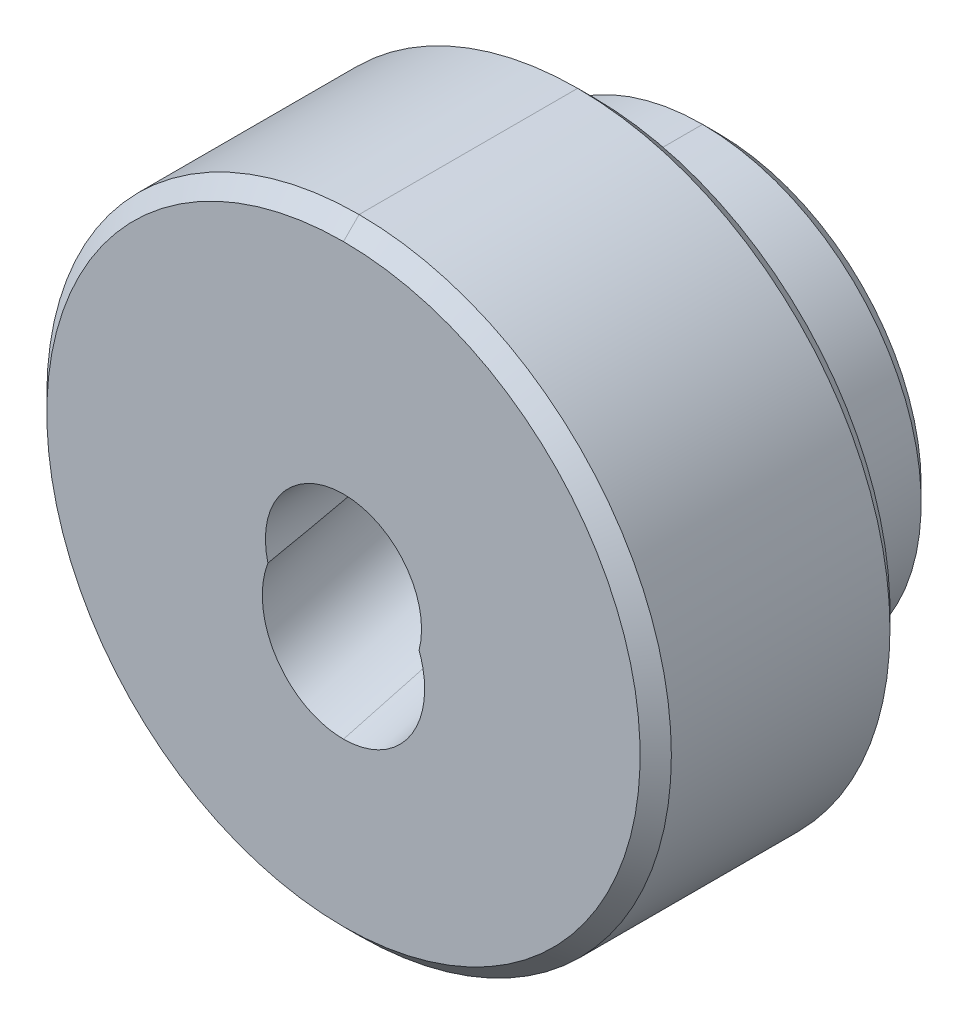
ISO-10303-21;
HEADER;
FILE_DESCRIPTION(('STEP AP214'),'2;1');
FILE_NAME('part.step','',(''),(''),'','','');
FILE_SCHEMA(('AUTOMOTIVE_DESIGN { 1 0 10303 214 1 1 1 1 }'));
ENDSEC;
DATA;
#1=APPLICATION_CONTEXT('core data for automotive mechanical design processes');
#2=APPLICATION_PROTOCOL_DEFINITION('international standard','automotive_design',2000,#1);
#3=PRODUCT_CONTEXT('',#1,'mechanical');
#4=PRODUCT('Part','Part','',(#3));
#5=PRODUCT_RELATED_PRODUCT_CATEGORY('part','',(#4));
#6=PRODUCT_DEFINITION_FORMATION('','',#4);
#7=PRODUCT_DEFINITION_CONTEXT('part definition',#1,'design');
#8=PRODUCT_DEFINITION('design','',#6,#7);
#9=PRODUCT_DEFINITION_SHAPE('','',#8);
#10=(LENGTH_UNIT() NAMED_UNIT(*) SI_UNIT(.MILLI.,.METRE.));
#11=(NAMED_UNIT(*) PLANE_ANGLE_UNIT() SI_UNIT($,.RADIAN.));
#12=(NAMED_UNIT(*) SI_UNIT($,.STERADIAN.) SOLID_ANGLE_UNIT());
#13=UNCERTAINTY_MEASURE_WITH_UNIT(LENGTH_MEASURE(1.E-05),#10,'distance_accuracy_value','');
#14=(GEOMETRIC_REPRESENTATION_CONTEXT(3) GLOBAL_UNCERTAINTY_ASSIGNED_CONTEXT((#13)) GLOBAL_UNIT_ASSIGNED_CONTEXT((#10,
#11,#12)) REPRESENTATION_CONTEXT('',''));
#15=CARTESIAN_POINT('',(0.,0.,0.));
#16=DIRECTION('',(0.,0.,1.));
#17=DIRECTION('',(1.,0.,0.));
#18=AXIS2_PLACEMENT_3D('',#15,#16,#17);
#19=CARTESIAN_POINT('',(0.,0.,3.5));
#20=DIRECTION('',(0.,0.,1.));
#21=DIRECTION('',(1.,0.,0.));
#22=AXIS2_PLACEMENT_3D('',#19,#20,#21);
#23=CYLINDRICAL_SURFACE('',#22,7.);
#24=CARTESIAN_POINT('',(0.,0.,3.5));
#25=DIRECTION('',(0.,0.,1.));
#26=DIRECTION('',(1.,0.,0.));
#27=AXIS2_PLACEMENT_3D('',#24,#25,#26);
#28=CIRCLE('',#27,7.);
#29=CARTESIAN_POINT('',(-7.,0.,3.5));
#30=VERTEX_POINT('',#29);
#31=CARTESIAN_POINT('',(0.,-7.,3.5));
#32=VERTEX_POINT('',#31);
#33=EDGE_CURVE('E280',#30,#32,#28,.T.);
#34=ORIENTED_EDGE('',*,*,#33,.F.);
#35=CARTESIAN_POINT('',(0.,0.,3.5));
#36=DIRECTION('',(0.,0.,1.));
#37=DIRECTION('',(1.,0.,0.));
#38=AXIS2_PLACEMENT_3D('',#35,#36,#37);
#39=CIRCLE('',#38,7.);
#40=CARTESIAN_POINT('',(0.,7.,3.5));
#41=VERTEX_POINT('',#40);
#42=EDGE_CURVE('E273',#41,#30,#39,.T.);
#43=ORIENTED_EDGE('',*,*,#42,.F.);
#44=DIRECTION('',(0.,0.,1.));
#45=VECTOR('',#44,1.);
#46=CARTESIAN_POINT('',(0.,7.,2.));
#47=LINE('',#46,#45);
#48=CARTESIAN_POINT('',(0.,7.,0.5));
#49=VERTEX_POINT('',#48);
#50=EDGE_CURVE('E115',#49,#41,#47,.T.);
#51=ORIENTED_EDGE('',*,*,#50,.F.);
#52=CARTESIAN_POINT('',(0.,0.,0.5));
#53=DIRECTION('',(0.,0.,-1.));
#54=DIRECTION('',(0.,1.,0.));
#55=AXIS2_PLACEMENT_3D('',#52,#53,#54);
#56=CIRCLE('',#55,7.);
#57=CARTESIAN_POINT('',(0.,-7.,0.5));
#58=VERTEX_POINT('',#57);
#59=EDGE_CURVE('E182',#58,#49,#56,.T.);
#60=ORIENTED_EDGE('',*,*,#59,.F.);
#61=DIRECTION('',(0.,0.,-1.));
#62=VECTOR('',#61,1.);
#63=CARTESIAN_POINT('',(0.,-7.,2.));
#64=LINE('',#63,#62);
#65=EDGE_CURVE('E486',#32,#58,#64,.T.);
#66=ORIENTED_EDGE('',*,*,#65,.F.);
#67=EDGE_LOOP('',(#34,#43,#51,#60,#66));
#68=FACE_BOUND('',#67,.T.);
#69=ADVANCED_FACE('F14',(#68),#23,.T.);
#70=CARTESIAN_POINT('',(0.,0.,3.5));
#71=DIRECTION('',(0.,0.,1.));
#72=DIRECTION('',(1.,0.,0.));
#73=AXIS2_PLACEMENT_3D('',#70,#71,#72);
#74=CYLINDRICAL_SURFACE('',#73,7.);
#75=ORIENTED_EDGE('',*,*,#65,.T.);
#76=CARTESIAN_POINT('',(0.,0.,0.5));
#77=DIRECTION('',(0.,0.,-1.));
#78=DIRECTION('',(0.,1.,0.));
#79=AXIS2_PLACEMENT_3D('',#76,#77,#78);
#80=CIRCLE('',#79,7.);
#81=EDGE_CURVE('E168',#49,#58,#80,.T.);
#82=ORIENTED_EDGE('',*,*,#81,.F.);
#83=ORIENTED_EDGE('',*,*,#50,.T.);
#84=CARTESIAN_POINT('',(0.,0.,3.5));
#85=DIRECTION('',(0.,0.,1.));
#86=DIRECTION('',(1.,0.,0.));
#87=AXIS2_PLACEMENT_3D('',#84,#85,#86);
#88=CIRCLE('',#87,7.);
#89=CARTESIAN_POINT('',(7.,0.,3.5));
#90=VERTEX_POINT('',#89);
#91=EDGE_CURVE('E271',#90,#41,#88,.T.);
#92=ORIENTED_EDGE('',*,*,#91,.F.);
#93=CARTESIAN_POINT('',(0.,0.,3.5));
#94=DIRECTION('',(0.,0.,1.));
#95=DIRECTION('',(1.,0.,0.));
#96=AXIS2_PLACEMENT_3D('',#93,#94,#95);
#97=CIRCLE('',#96,7.);
#98=EDGE_CURVE('E216',#32,#90,#97,.T.);
#99=ORIENTED_EDGE('',*,*,#98,.F.);
#100=EDGE_LOOP('',(#75,#82,#83,#92,#99));
#101=FACE_BOUND('',#100,.T.);
#102=ADVANCED_FACE('F466',(#101),#74,.T.);
#103=CARTESIAN_POINT('',(0.,0.,3.5));
#104=DIRECTION('',(0.,0.,1.));
#105=DIRECTION('',(1.,0.,0.));
#106=AXIS2_PLACEMENT_3D('',#103,#104,#105);
#107=TOROIDAL_SURFACE('',#106,7.5,0.5);
#108=CARTESIAN_POINT('',(7.5,0.,3.5));
#109=DIRECTION('',(0.,-1.,0.));
#110=DIRECTION('',(-1.,0.,0.));
#111=AXIS2_PLACEMENT_3D('',#108,#109,#110);
#112=CIRCLE('',#111,0.5);
#113=CARTESIAN_POINT('',(7.5,0.,4.));
#114=VERTEX_POINT('',#113);
#115=EDGE_CURVE('E215',#114,#90,#112,.T.);
#116=ORIENTED_EDGE('',*,*,#115,.F.);
#117=CARTESIAN_POINT('',(0.,0.,4.));
#118=DIRECTION('',(0.,0.,-1.));
#119=DIRECTION('',(1.,0.,0.));
#120=AXIS2_PLACEMENT_3D('',#117,#118,#119);
#121=CIRCLE('',#120,7.5);
#122=CARTESIAN_POINT('',(-7.5,0.,4.));
#123=VERTEX_POINT('',#122);
#124=EDGE_CURVE('E156',#123,#114,#121,.F.);
#125=ORIENTED_EDGE('',*,*,#124,.F.);
#126=CARTESIAN_POINT('',(-7.5,0.,3.5));
#127=DIRECTION('',(0.,1.,0.));
#128=DIRECTION('',(1.,0.,0.));
#129=AXIS2_PLACEMENT_3D('',#126,#127,#128);
#130=CIRCLE('',#129,0.5);
#131=EDGE_CURVE('E208',#30,#123,#130,.F.);
#132=ORIENTED_EDGE('',*,*,#131,.F.);
#133=ORIENTED_EDGE('',*,*,#33,.T.);
#134=ORIENTED_EDGE('',*,*,#98,.T.);
#135=EDGE_LOOP('',(#116,#125,#132,#133,#134));
#136=FACE_BOUND('',#135,.T.);
#137=ADVANCED_FACE('F193',(#136),#107,.F.);
#138=CARTESIAN_POINT('',(0.,0.,3.5));
#139=DIRECTION('',(0.,0.,1.));
#140=DIRECTION('',(1.,0.,0.));
#141=AXIS2_PLACEMENT_3D('',#138,#139,#140);
#142=TOROIDAL_SURFACE('',#141,7.5,0.5);
#143=ORIENTED_EDGE('',*,*,#91,.T.);
#144=ORIENTED_EDGE('',*,*,#42,.T.);
#145=ORIENTED_EDGE('',*,*,#131,.T.);
#146=CARTESIAN_POINT('',(0.,0.,4.));
#147=DIRECTION('',(0.,0.,-1.));
#148=DIRECTION('',(-1.,0.,0.));
#149=AXIS2_PLACEMENT_3D('',#146,#147,#148);
#150=CIRCLE('',#149,7.5);
#151=CARTESIAN_POINT('',(0.,7.5,4.));
#152=VERTEX_POINT('',#151);
#153=EDGE_CURVE('E162',#152,#123,#150,.F.);
#154=ORIENTED_EDGE('',*,*,#153,.F.);
#155=CARTESIAN_POINT('',(0.,0.,4.));
#156=DIRECTION('',(0.,0.,-1.));
#157=DIRECTION('',(0.,1.,0.));
#158=AXIS2_PLACEMENT_3D('',#155,#156,#157);
#159=CIRCLE('',#158,7.5);
#160=EDGE_CURVE('E151',#114,#152,#159,.F.);
#161=ORIENTED_EDGE('',*,*,#160,.F.);
#162=ORIENTED_EDGE('',*,*,#115,.T.);
#163=EDGE_LOOP('',(#143,#144,#145,#154,#161,#162));
#164=FACE_BOUND('',#163,.T.);
#165=ADVANCED_FACE('F187',(#164),#142,.F.);
#166=CARTESIAN_POINT('',(0.,0.,0.));
#167=DIRECTION('',(0.,0.,1.));
#168=DIRECTION('',(1.,0.,0.));
#169=AXIS2_PLACEMENT_3D('',#166,#167,#168);
#170=CONICAL_SURFACE('',#169,6.5,0.785398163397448);
#171=DIRECTION('',(0.,0.707106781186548,-0.707106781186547));
#172=VECTOR('',#171,1.);
#173=CARTESIAN_POINT('',(0.,-4.94974746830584,-1.55025253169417));
#174=LINE('',#173,#172);
#175=CARTESIAN_POINT('',(0.,-6.5,0.));
#176=VERTEX_POINT('',#175);
#177=EDGE_CURVE('E165',#58,#176,#174,.T.);
#178=ORIENTED_EDGE('',*,*,#177,.F.);
#179=ORIENTED_EDGE('',*,*,#59,.T.);
#180=DIRECTION('',(0.,0.707106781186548,0.707106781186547));
#181=VECTOR('',#180,1.);
#182=CARTESIAN_POINT('',(0.,4.94974746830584,-1.55025253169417));
#183=LINE('',#182,#181);
#184=CARTESIAN_POINT('',(0.,6.5,0.));
#185=VERTEX_POINT('',#184);
#186=EDGE_CURVE('E174',#185,#49,#183,.T.);
#187=ORIENTED_EDGE('',*,*,#186,.F.);
#188=CARTESIAN_POINT('',(0.,0.,0.));
#189=DIRECTION('',(0.,0.,1.));
#190=DIRECTION('',(1.,0.,0.));
#191=AXIS2_PLACEMENT_3D('',#188,#189,#190);
#192=CIRCLE('',#191,6.5);
#193=EDGE_CURVE('E148',#176,#185,#192,.F.);
#194=ORIENTED_EDGE('',*,*,#193,.F.);
#195=EDGE_LOOP('',(#178,#179,#187,#194));
#196=FACE_BOUND('',#195,.T.);
#197=ADVANCED_FACE('F192',(#196),#170,.T.);
#198=CARTESIAN_POINT('',(0.,0.,0.));
#199=DIRECTION('',(0.,0.,1.));
#200=DIRECTION('',(1.,0.,0.));
#201=AXIS2_PLACEMENT_3D('',#198,#199,#200);
#202=CONICAL_SURFACE('',#201,6.5,0.785398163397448);
#203=ORIENTED_EDGE('',*,*,#177,.T.);
#204=CARTESIAN_POINT('',(0.,0.,0.));
#205=DIRECTION('',(0.,0.,1.));
#206=DIRECTION('',(1.,0.,0.));
#207=AXIS2_PLACEMENT_3D('',#204,#205,#206);
#208=CIRCLE('',#207,6.5);
#209=EDGE_CURVE('E145',#185,#176,#208,.F.);
#210=ORIENTED_EDGE('',*,*,#209,.F.);
#211=ORIENTED_EDGE('',*,*,#186,.T.);
#212=ORIENTED_EDGE('',*,*,#81,.T.);
#213=EDGE_LOOP('',(#203,#210,#211,#212));
#214=FACE_BOUND('',#213,.T.);
#215=ADVANCED_FACE('F233',(#214),#202,.T.);
#216=CARTESIAN_POINT('',(9.61400210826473,9.5,4.));
#217=DIRECTION('',(0.,0.,-1.));
#218=DIRECTION('',(0.,-1.,0.));
#219=AXIS2_PLACEMENT_3D('',#216,#217,#218);
#220=PLANE('',#219);
#221=ORIENTED_EDGE('',*,*,#124,.T.);
#222=ORIENTED_EDGE('',*,*,#160,.T.);
#223=ORIENTED_EDGE('',*,*,#153,.T.);
#224=EDGE_LOOP('',(#221,#222,#223));
#225=FACE_BOUND('',#224,.T.);
#226=CARTESIAN_POINT('',(0.,0.,4.));
#227=DIRECTION('',(0.,0.,1.));
#228=DIRECTION('',(1.,0.,0.));
#229=AXIS2_PLACEMENT_3D('',#226,#227,#228);
#230=CIRCLE('',#229,9.5);
#231=CARTESIAN_POINT('',(0.,9.5,4.));
#232=VERTEX_POINT('',#231);
#233=CARTESIAN_POINT('',(0.,-9.5,4.));
#234=VERTEX_POINT('',#233);
#235=EDGE_CURVE('E140',#232,#234,#230,.T.);
#236=ORIENTED_EDGE('',*,*,#235,.F.);
#237=CARTESIAN_POINT('',(0.,0.,4.));
#238=DIRECTION('',(0.,0.,1.));
#239=DIRECTION('',(1.,0.,0.));
#240=AXIS2_PLACEMENT_3D('',#237,#238,#239);
#241=CIRCLE('',#240,9.5);
#242=EDGE_CURVE('E150',#234,#232,#241,.T.);
#243=ORIENTED_EDGE('',*,*,#242,.F.);
#244=EDGE_LOOP('',(#236,#243));
#245=FACE_BOUND('',#244,.T.);
#246=ADVANCED_FACE('F223',(#225,#245),#220,.T.);
#247=CARTESIAN_POINT('',(0.,0.,4.));
#248=DIRECTION('',(0.,0.,1.));
#249=DIRECTION('',(1.,0.,0.));
#250=AXIS2_PLACEMENT_3D('',#247,#248,#249);
#251=CONICAL_SURFACE('',#250,9.5,0.785398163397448);
#252=DIRECTION('',(0.,-0.707106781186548,0.707106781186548));
#253=VECTOR('',#252,1.);
#254=CARTESIAN_POINT('',(0.,-7.07106781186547,1.57106781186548));
#255=LINE('',#254,#253);
#256=CARTESIAN_POINT('',(0.,-10.,4.5));
#257=VERTEX_POINT('',#256);
#258=EDGE_CURVE('E143',#234,#257,#255,.T.);
#259=ORIENTED_EDGE('',*,*,#258,.F.);
#260=ORIENTED_EDGE('',*,*,#242,.T.);
#261=DIRECTION('',(0.,-0.707106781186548,-0.707106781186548));
#262=VECTOR('',#261,1.);
#263=CARTESIAN_POINT('',(0.,7.07106781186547,1.57106781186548));
#264=LINE('',#263,#262);
#265=CARTESIAN_POINT('',(0.,10.,4.5));
#266=VERTEX_POINT('',#265);
#267=EDGE_CURVE('E144',#266,#232,#264,.T.);
#268=ORIENTED_EDGE('',*,*,#267,.F.);
#269=CARTESIAN_POINT('',(0.,0.,4.5));
#270=DIRECTION('',(0.,0.,1.));
#271=DIRECTION('',(0.,1.,0.));
#272=AXIS2_PLACEMENT_3D('',#269,#270,#271);
#273=CIRCLE('',#272,10.);
#274=EDGE_CURVE('E309',#257,#266,#273,.T.);
#275=ORIENTED_EDGE('',*,*,#274,.F.);
#276=EDGE_LOOP('',(#259,#260,#268,#275));
#277=FACE_BOUND('',#276,.T.);
#278=ADVANCED_FACE('F232',(#277),#251,.T.);
#279=CARTESIAN_POINT('',(6.57800210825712,6.5,0.));
#280=DIRECTION('',(0.,0.,-1.));
#281=DIRECTION('',(0.,-1.,0.));
#282=AXIS2_PLACEMENT_3D('',#279,#280,#281);
#283=PLANE('',#282);
#284=CARTESIAN_POINT('',(0.,0.,0.));
#285=DIRECTION('',(0.,0.,-1.));
#286=DIRECTION('',(-1.,0.,0.));
#287=AXIS2_PLACEMENT_3D('',#284,#285,#286);
#288=CIRCLE('',#287,2.5);
#289=CARTESIAN_POINT('',(2.42058312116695,0.625121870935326,0.));
#290=VERTEX_POINT('',#289);
#291=CARTESIAN_POINT('',(-2.42058312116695,0.625121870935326,0.));
#292=VERTEX_POINT('',#291);
#293=EDGE_CURVE('E28',#290,#292,#288,.T.);
#294=ORIENTED_EDGE('',*,*,#293,.F.);
#295=CARTESIAN_POINT('',(0.,1.60769515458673,0.));
#296=DIRECTION('',(0.,0.,-1.));
#297=DIRECTION('',(0.,-1.,0.));
#298=AXIS2_PLACEMENT_3D('',#295,#296,#297);
#299=ELLIPSE('',#298,2.69171806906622,2.6);
#300=CARTESIAN_POINT('',(0.,4.29941322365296,0.));
#301=VERTEX_POINT('',#300);
#302=EDGE_CURVE('E122',#301,#290,#299,.T.);
#303=ORIENTED_EDGE('',*,*,#302,.F.);
#304=CARTESIAN_POINT('',(0.,1.60769515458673,0.));
#305=DIRECTION('',(0.,0.,-1.));
#306=DIRECTION('',(0.,-1.,0.));
#307=AXIS2_PLACEMENT_3D('',#304,#305,#306);
#308=ELLIPSE('',#307,2.69171806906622,2.6);
#309=EDGE_CURVE('E124',#292,#301,#308,.T.);
#310=ORIENTED_EDGE('',*,*,#309,.F.);
#311=EDGE_LOOP('',(#294,#303,#310));
#312=FACE_BOUND('',#311,.T.);
#313=ORIENTED_EDGE('',*,*,#193,.T.);
#314=ORIENTED_EDGE('',*,*,#209,.T.);
#315=EDGE_LOOP('',(#313,#314));
#316=FACE_BOUND('',#315,.T.);
#317=ADVANCED_FACE('F120',(#312,#316),#283,.T.);
#318=CARTESIAN_POINT('',(0.,0.,4.));
#319=DIRECTION('',(0.,0.,1.));
#320=DIRECTION('',(1.,0.,0.));
#321=AXIS2_PLACEMENT_3D('',#318,#319,#320);
#322=CONICAL_SURFACE('',#321,9.5,0.785398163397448);
#323=ORIENTED_EDGE('',*,*,#258,.T.);
#324=CARTESIAN_POINT('',(0.,0.,4.5));
#325=DIRECTION('',(0.,0.,1.));
#326=DIRECTION('',(0.,1.,0.));
#327=AXIS2_PLACEMENT_3D('',#324,#325,#326);
#328=CIRCLE('',#327,10.);
#329=EDGE_CURVE('E178',#266,#257,#328,.T.);
#330=ORIENTED_EDGE('',*,*,#329,.F.);
#331=ORIENTED_EDGE('',*,*,#267,.T.);
#332=ORIENTED_EDGE('',*,*,#235,.T.);
#333=EDGE_LOOP('',(#323,#330,#331,#332));
#334=FACE_BOUND('',#333,.T.);
#335=ADVANCED_FACE('F372',(#334),#322,.T.);
#336=CARTESIAN_POINT('',(0.,0.,11.5));
#337=DIRECTION('',(0.,0.,1.));
#338=DIRECTION('',(1.,0.,0.));
#339=AXIS2_PLACEMENT_3D('',#336,#337,#338);
#340=CYLINDRICAL_SURFACE('',#339,10.);
#341=DIRECTION('',(0.,0.,1.));
#342=VECTOR('',#341,1.);
#343=CARTESIAN_POINT('',(0.,-10.,8.));
#344=LINE('',#343,#342);
#345=CARTESIAN_POINT('',(0.,-10.,11.5));
#346=VERTEX_POINT('',#345);
#347=EDGE_CURVE('E290',#257,#346,#344,.T.);
#348=ORIENTED_EDGE('',*,*,#347,.F.);
#349=ORIENTED_EDGE('',*,*,#274,.T.);
#350=DIRECTION('',(0.,0.,-1.));
#351=VECTOR('',#350,1.);
#352=CARTESIAN_POINT('',(0.,10.,8.));
#353=LINE('',#352,#351);
#354=CARTESIAN_POINT('',(0.,10.,11.5));
#355=VERTEX_POINT('',#354);
#356=EDGE_CURVE('E301',#355,#266,#353,.T.);
#357=ORIENTED_EDGE('',*,*,#356,.F.);
#358=CARTESIAN_POINT('',(0.,0.,11.5));
#359=DIRECTION('',(0.,0.,1.));
#360=DIRECTION('',(0.,1.,0.));
#361=AXIS2_PLACEMENT_3D('',#358,#359,#360);
#362=CIRCLE('',#361,10.);
#363=EDGE_CURVE('E130',#346,#355,#362,.T.);
#364=ORIENTED_EDGE('',*,*,#363,.F.);
#365=EDGE_LOOP('',(#348,#349,#357,#364));
#366=FACE_BOUND('',#365,.T.);
#367=ADVANCED_FACE('F365',(#366),#340,.T.);
#368=CARTESIAN_POINT('',(0.,0.,12.));
#369=DIRECTION('',(0.,0.,-1.));
#370=DIRECTION('',(-1.,0.,0.));
#371=AXIS2_PLACEMENT_3D('',#368,#369,#370);
#372=CONICAL_SURFACE('',#371,9.5,0.785398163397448);
#373=DIRECTION('',(0.,-0.707106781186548,-0.707106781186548));
#374=VECTOR('',#373,1.);
#375=CARTESIAN_POINT('',(0.,-7.07106781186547,14.4289321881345));
#376=LINE('',#375,#374);
#377=CARTESIAN_POINT('',(0.,-9.5,12.));
#378=VERTEX_POINT('',#377);
#379=EDGE_CURVE('E135',#378,#346,#376,.T.);
#380=ORIENTED_EDGE('',*,*,#379,.T.);
#381=ORIENTED_EDGE('',*,*,#363,.T.);
#382=DIRECTION('',(0.,-0.707106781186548,0.707106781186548));
#383=VECTOR('',#382,1.);
#384=CARTESIAN_POINT('',(0.,7.07106781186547,14.4289321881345));
#385=LINE('',#384,#383);
#386=CARTESIAN_POINT('',(0.,9.5,12.));
#387=VERTEX_POINT('',#386);
#388=EDGE_CURVE('E311',#355,#387,#385,.T.);
#389=ORIENTED_EDGE('',*,*,#388,.T.);
#390=CARTESIAN_POINT('',(0.,0.,12.));
#391=DIRECTION('',(0.,0.,-1.));
#392=DIRECTION('',(-1.,0.,0.));
#393=AXIS2_PLACEMENT_3D('',#390,#391,#392);
#394=CIRCLE('',#393,9.5);
#395=EDGE_CURVE('E288',#378,#387,#394,.F.);
#396=ORIENTED_EDGE('',*,*,#395,.F.);
#397=EDGE_LOOP('',(#380,#381,#389,#396));
#398=FACE_BOUND('',#397,.T.);
#399=ADVANCED_FACE('F363',(#398),#372,.T.);
#400=CARTESIAN_POINT('',(0.,1.78810110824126,-0.673284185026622));
#401=DIRECTION('',(0.,-0.25881904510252,0.965925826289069));
#402=DIRECTION('',(0.,-0.965925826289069,-0.25881904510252));
#403=AXIS2_PLACEMENT_3D('',#400,#401,#402);
#404=CYLINDRICAL_SURFACE('',#403,2.6);
#405=CARTESIAN_POINT('',(0.,2.5,6.71550157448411));
#406=CARTESIAN_POINT('',(0.0702065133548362,2.50000683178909,6.71550781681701));
#407=CARTESIAN_POINT('',(0.140410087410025,2.49704270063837,6.71555189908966));
#408=CARTESIAN_POINT('',(0.280316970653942,2.4852247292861,6.71576068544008));
#409=CARTESIAN_POINT('',(0.350020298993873,2.47637111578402,6.71592538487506));
#410=CARTESIAN_POINT('',(0.488353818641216,2.45284067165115,6.7164200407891));
#411=CARTESIAN_POINT('',(0.556985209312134,2.43817091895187,6.71674979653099));
#412=CARTESIAN_POINT('',(0.69275444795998,2.40312547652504,6.71767088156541));
#413=CARTESIAN_POINT('',(0.759892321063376,2.38274988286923,6.71826220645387));
#414=CARTESIAN_POINT('',(0.958392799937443,2.31324564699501,6.72061843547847));
#415=CARTESIAN_POINT('',(1.08691525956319,2.2557270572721,6.72296560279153));
#416=CARTESIAN_POINT('',(1.33256067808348,2.11990274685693,6.7309698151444));
#417=CARTESIAN_POINT('',(1.44967155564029,2.04157531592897,6.73663032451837));
#418=CARTESIAN_POINT('',(1.61366891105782,1.91074705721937,6.75013351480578));
#419=CARTESIAN_POINT('',(1.66629045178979,1.86502587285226,6.75545341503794));
#420=CARTESIAN_POINT('',(1.7673771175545,1.76952045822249,6.7684426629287));
#421=CARTESIAN_POINT('',(1.81584436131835,1.71973832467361,6.77611080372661));
#422=CARTESIAN_POINT('',(1.90812831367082,1.61673099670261,6.79466584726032));
#423=CARTESIAN_POINT('',(1.95195274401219,1.56351176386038,6.80554728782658));
#424=CARTESIAN_POINT('',(2.03457248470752,1.45437103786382,6.83171139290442));
#425=CARTESIAN_POINT('',(2.07337196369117,1.3984518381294,6.84699037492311));
#426=CARTESIAN_POINT('',(2.15131636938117,1.27589270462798,6.88637999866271));
#427=CARTESIAN_POINT('',(2.1895243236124,1.20896837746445,6.91151222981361));
#428=CARTESIAN_POINT('',(2.25788492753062,1.07588414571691,6.97220888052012));
#429=CARTESIAN_POINT('',(2.28806109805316,1.00972256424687,7.00774218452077));
#430=CARTESIAN_POINT('',(2.34055113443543,0.881295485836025,7.09108427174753));
#431=CARTESIAN_POINT('',(2.36280429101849,0.819062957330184,7.13898318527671));
#432=CARTESIAN_POINT('',(2.4001028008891,0.702356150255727,7.24576266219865));
#433=CARTESIAN_POINT('',(2.41514254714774,0.647887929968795,7.30465171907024));
#434=CARTESIAN_POINT('',(2.43601028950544,0.563134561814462,7.41072703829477));
#435=CARTESIAN_POINT('',(2.44324867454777,0.530580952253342,7.45589776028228));
#436=CARTESIAN_POINT('',(2.45577567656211,0.469199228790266,7.54898163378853));
#437=CARTESIAN_POINT('',(2.46106314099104,0.440373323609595,7.59689638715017));
#438=CARTESIAN_POINT('',(2.4702014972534,0.385840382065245,7.69489364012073));
#439=CARTESIAN_POINT('',(2.47404494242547,0.360149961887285,7.74498592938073));
#440=CARTESIAN_POINT('',(2.48063554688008,0.311520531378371,7.8465236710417));
#441=CARTESIAN_POINT('',(2.48338304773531,0.288580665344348,7.89796869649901));
#442=CARTESIAN_POINT('',(2.49034585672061,0.223763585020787,8.05219869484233));
#443=CARTESIAN_POINT('',(2.49339980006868,0.185101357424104,8.15637861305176));
#444=CARTESIAN_POINT('',(2.49767119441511,0.113579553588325,8.36677297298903));
#445=CARTESIAN_POINT('',(2.49888693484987,0.0807254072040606,8.47298921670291));
#446=CARTESIAN_POINT('',(2.50011905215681,0.0189698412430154,8.68684219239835));
#447=CARTESIAN_POINT('',(2.50013246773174,-0.00992164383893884,8.79448177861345));
#448=CARTESIAN_POINT('',(2.49930881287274,-0.0648237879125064,9.0104955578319));
#449=CARTESIAN_POINT('',(2.4984716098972,-0.0908339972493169,9.11886986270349));
#450=CARTESIAN_POINT('',(2.49499520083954,-0.165980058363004,9.4456802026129));
#451=CARTESIAN_POINT('',(2.49139010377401,-0.211966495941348,9.66482475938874));
#452=CARTESIAN_POINT('',(2.48242130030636,-0.299111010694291,10.1036671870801));
#453=CARTESIAN_POINT('',(2.47706018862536,-0.340276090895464,10.3233637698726));
#454=CARTESIAN_POINT('',(2.46703512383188,-0.40546477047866,10.6849811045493));
#455=CARTESIAN_POINT('',(2.46280209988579,-0.430374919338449,10.8267548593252));
#456=CARTESIAN_POINT('',(2.45376277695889,-0.479234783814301,11.11050609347));
#457=CARTESIAN_POINT('',(2.44895625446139,-0.503184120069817,11.2524836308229));
#458=CARTESIAN_POINT('',(2.4388427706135,-0.550106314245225,11.5352123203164));
#459=CARTESIAN_POINT('',(2.43354092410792,-0.573086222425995,11.6759624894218));
#460=CARTESIAN_POINT('',(2.42241144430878,-0.618436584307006,11.9574807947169));
#461=CARTESIAN_POINT('',(2.41658402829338,-0.640807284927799,12.0982488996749));
#462=CARTESIAN_POINT('',(2.41049766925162,-0.662948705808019,12.2390412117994));
#463=B_SPLINE_CURVE_WITH_KNOTS('',3,(#405,#406,#407,#408,#409,#410,#411,#412,#413,#414,#415,
#416,#417,#418,#419,#420,#421,#422,#423,#424,#425,#426,#427,#428,#429,#430,#431,#432,#433,#434,
#435,#436,#437,#438,#439,#440,#441,#442,#443,#444,#445,#446,#447,#448,#449,#450,#451,#452,#453,
#454,#455,#456,#457,#458,#459,#460,#461,#462),.UNSPECIFIED.,.F.,.F.,(4,2,2,2,2,2,2,2,2,2,2,2,2,
2,2,2,2,2,2,2,2,2,2,2,2,2,2,2,4),(0.,0.210551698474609,0.421095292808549,0.631383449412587,
0.841668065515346,1.26201795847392,1.68280814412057,1.89231567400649,2.10171570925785,
2.31076182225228,2.51963338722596,2.76190670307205,3.00346252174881,3.24683130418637,
3.49038895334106,3.6585993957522,3.82690905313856,3.99607512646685,4.16518843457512,
4.49834227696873,4.83180594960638,5.16609091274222,5.50042797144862,6.17214172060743,
6.84286737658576,7.27488527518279,7.7070721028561,8.13520660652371,8.56316491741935),.UNSPECIFIED.);
#464=CARTESIAN_POINT('',(0.,2.5,6.71550157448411));
#465=VERTEX_POINT('',#464);
#466=CARTESIAN_POINT('',(2.42058312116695,-0.625121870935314,12.));
#467=VERTEX_POINT('',#466);
#468=EDGE_CURVE('E35',#465,#467,#463,.T.);
#469=ORIENTED_EDGE('',*,*,#468,.F.);
#470=DIRECTION('',(0.,-0.258819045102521,0.965925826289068));
#471=VECTOR('',#470,1.);
#472=CARTESIAN_POINT('',(0.,2.51140714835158,6.67292951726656));
#473=LINE('',#472,#471);
#474=EDGE_CURVE('E129',#301,#465,#473,.T.);
#475=ORIENTED_EDGE('',*,*,#474,.F.);
#476=ORIENTED_EDGE('',*,*,#302,.T.);
#477=CARTESIAN_POINT('',(0.,-2.5,5.28449842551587));
#478=CARTESIAN_POINT('',(0.0702064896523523,-2.50000683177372,5.28449218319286));
#479=CARTESIAN_POINT('',(0.140410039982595,-2.49704270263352,5.28444810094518));
#480=CARTESIAN_POINT('',(0.280316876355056,-2.48522473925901,5.28423931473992));
#481=CARTESIAN_POINT('',(0.350020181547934,-2.4763711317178,5.28407461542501));
#482=CARTESIAN_POINT('',(0.48835370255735,-2.45284069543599,5.28357995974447));
#483=CARTESIAN_POINT('',(0.556985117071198,-2.43817094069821,5.28325020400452));
#484=CARTESIAN_POINT('',(0.692754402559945,-2.40312549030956,5.28232911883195));
#485=CARTESIAN_POINT('',(0.75989229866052,-2.38274989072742,5.28173779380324));
#486=CARTESIAN_POINT('',(0.958392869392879,-2.31324562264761,5.2793815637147));
#487=CARTESIAN_POINT('',(1.0869153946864,-2.25572699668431,5.27703439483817));
#488=CARTESIAN_POINT('',(1.33256080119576,-2.11990266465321,5.26903017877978));
#489=CARTESIAN_POINT('',(1.4496716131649,-2.04157527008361,5.26336967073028));
#490=CARTESIAN_POINT('',(1.61366880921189,-1.91074713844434,5.24986649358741));
#491=CARTESIAN_POINT('',(1.66629025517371,-1.86502604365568,5.24454660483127));
#492=CARTESIAN_POINT('',(1.76737674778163,-1.769520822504,5.231557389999));
#493=CARTESIAN_POINT('',(1.8158439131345,-1.71973879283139,5.22388927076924));
#494=CARTESIAN_POINT('',(1.90812789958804,-1.61673149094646,5.20533425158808));
#495=CARTESIAN_POINT('',(1.95195242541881,-1.5635121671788,5.1944528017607));
#496=CARTESIAN_POINT('',(2.03457233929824,-1.45437124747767,5.16828866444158));
#497=CARTESIAN_POINT('',(2.0733718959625,-1.3984519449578,5.1530096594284));
#498=CARTESIAN_POINT('',(2.15131658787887,-1.27589236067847,5.11361989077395));
#499=CARTESIAN_POINT('',(2.18952472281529,-1.20896767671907,5.08848750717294));
#500=CARTESIAN_POINT('',(2.25788524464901,-1.07588345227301,5.027790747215));
#501=CARTESIAN_POINT('',(2.28806123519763,-1.00972222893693,4.99225759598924));
#502=CARTESIAN_POINT('',(2.34055082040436,-0.881296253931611,4.90891622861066));
#503=CARTESIAN_POINT('',(2.36280376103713,-0.819064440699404,4.86101796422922));
#504=CARTESIAN_POINT('',(2.40010244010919,-0.702357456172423,4.75423874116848));
#505=CARTESIAN_POINT('',(2.41514239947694,-0.647888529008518,4.69534902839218));
#506=CARTESIAN_POINT('',(2.43601042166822,-0.563134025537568,4.58927229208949));
#507=CARTESIAN_POINT('',(2.44324889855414,-0.530579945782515,4.54410084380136));
#508=CARTESIAN_POINT('',(2.45577603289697,-0.469197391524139,4.45101544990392));
#509=CARTESIAN_POINT('',(2.46106353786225,-0.440371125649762,4.40309990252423));
#510=CARTESIAN_POINT('',(2.4702018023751,-0.38583839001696,4.30510253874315));
#511=CARTESIAN_POINT('',(2.47404516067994,-0.360148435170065,4.25501099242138));
#512=CARTESIAN_POINT('',(2.48063562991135,-0.311519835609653,4.15347476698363));
#513=CARTESIAN_POINT('',(2.48338308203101,-0.288580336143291,4.10203051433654));
#514=CARTESIAN_POINT('',(2.49034655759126,-0.223757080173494,3.94778583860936));
#515=CARTESIAN_POINT('',(2.49340073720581,-0.185089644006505,3.84358989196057));
#516=CARTESIAN_POINT('',(2.49767219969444,-0.113558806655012,3.63316304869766));
#517=CARTESIAN_POINT('',(2.49888777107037,-0.0807008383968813,3.52693034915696));
#518=CARTESIAN_POINT('',(2.50011932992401,-0.0189385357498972,3.31304474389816));
#519=CARTESIAN_POINT('',(2.50013236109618,0.00995588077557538,3.20538898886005));
#520=CARTESIAN_POINT('',(2.49930781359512,0.0648634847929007,2.98934281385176));
#521=CARTESIAN_POINT('',(2.49847010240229,0.0908762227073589,2.88095228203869));
#522=CARTESIAN_POINT('',(2.49499271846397,0.166014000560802,2.55416034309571));
#523=CARTESIAN_POINT('',(2.49138778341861,0.211991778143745,2.33505095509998));
#524=CARTESIAN_POINT('',(2.48241986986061,0.299122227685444,1.89627336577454));
#525=CARTESIAN_POINT('',(2.47705943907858,0.34028177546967,1.67660642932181));
#526=CARTESIAN_POINT('',(2.46759020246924,0.401854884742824,1.33504284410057));
#527=CARTESIAN_POINT('',(2.46399248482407,0.423320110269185,1.21332044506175));
#528=CARTESIAN_POINT('',(2.45637060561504,0.465514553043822,0.969717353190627));
#529=CARTESIAN_POINT('',(2.45234629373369,0.486243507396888,0.847836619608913));
#530=CARTESIAN_POINT('',(2.44392381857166,0.526939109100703,0.604976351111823));
#531=CARTESIAN_POINT('',(2.43952894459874,0.546910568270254,0.483997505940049));
#532=CARTESIAN_POINT('',(2.43034774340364,0.586359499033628,0.24201989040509));
#533=CARTESIAN_POINT('',(2.42556156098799,0.605837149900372,0.121021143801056));
#534=CARTESIAN_POINT('',(2.42058312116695,0.625121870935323,0.));
#535=B_SPLINE_CURVE_WITH_KNOTS('',3,(#477,#478,#479,#480,#481,#482,#483,#484,#485,#486,#487,
#488,#489,#490,#491,#492,#493,#494,#495,#496,#497,#498,#499,#500,#501,#502,#503,#504,#505,#506,
#507,#508,#509,#510,#511,#512,#513,#514,#515,#516,#517,#518,#519,#520,#521,#522,#523,#524,#525,
#526,#527,#528,#529,#530,#531,#532,#533,#534),.UNSPECIFIED.,.F.,.F.,(4,2,2,2,2,2,2,2,2,2,2,2,2,
2,2,2,2,2,2,2,2,2,2,2,2,2,2,2,4),(0.,0.210551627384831,0.421095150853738,0.631383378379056,
0.841668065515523,1.26201817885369,1.68280814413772,1.89231528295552,2.10171492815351,
2.31076143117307,2.51963338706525,2.76190796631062,3.00346252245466,3.24682840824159,
3.4903889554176,3.65860199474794,3.82691424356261,3.9960776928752,4.16518843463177,
4.49839265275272,4.83190684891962,5.16624092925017,5.50062709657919,6.17223243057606,
6.84286735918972,7.21382278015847,7.58490935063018,7.95299259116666,8.32094023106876),.UNSPECIFIED.);
#536=CARTESIAN_POINT('',(0.,-2.5,5.28449842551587));
#537=VERTEX_POINT('',#536);
#538=EDGE_CURVE('E108',#537,#290,#535,.T.);
#539=ORIENTED_EDGE('',*,*,#538,.F.);
#540=DIRECTION('',(0.,0.258819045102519,-0.965925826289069));
#541=VECTOR('',#540,1.);
#542=CARTESIAN_POINT('',(0.,-2.51140714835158,5.32707048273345));
#543=LINE('',#542,#541);
#544=CARTESIAN_POINT('',(0.,-4.29941322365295,12.));
#545=VERTEX_POINT('',#544);
#546=EDGE_CURVE('E132',#545,#537,#543,.T.);
#547=ORIENTED_EDGE('',*,*,#546,.F.);
#548=CARTESIAN_POINT('',(0.,-1.60769515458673,12.));
#549=DIRECTION('',(0.,0.,1.));
#550=DIRECTION('',(0.,-1.,0.));
#551=AXIS2_PLACEMENT_3D('',#548,#549,#550);
#552=ELLIPSE('',#551,2.69171806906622,2.6);
#553=EDGE_CURVE('E287',#467,#545,#552,.F.);
#554=ORIENTED_EDGE('',*,*,#553,.F.);
#555=EDGE_LOOP('',(#469,#475,#476,#539,#547,#554));
#556=FACE_BOUND('',#555,.T.);
#557=ADVANCED_FACE('F127',(#556),#404,.F.);
#558=CARTESIAN_POINT('',(0.,1.78810110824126,-0.673284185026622));
#559=DIRECTION('',(0.,-0.25881904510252,0.965925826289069));
#560=DIRECTION('',(0.,-0.965925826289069,-0.25881904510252));
#561=AXIS2_PLACEMENT_3D('',#558,#559,#560);
#562=CYLINDRICAL_SURFACE('',#561,2.6);
#563=CARTESIAN_POINT('',(-2.41049766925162,-0.662948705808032,12.2390412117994));
#564=CARTESIAN_POINT('',(-2.41610908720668,-0.642539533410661,12.109246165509));
#565=CARTESIAN_POINT('',(-2.42149976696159,-0.621931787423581,11.9794725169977));
#566=CARTESIAN_POINT('',(-2.43183339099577,-0.58021515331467,11.7199847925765));
#567=CARTESIAN_POINT('',(-2.43677632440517,-0.55910625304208,11.590270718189));
#568=CARTESIAN_POINT('',(-2.45093281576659,-0.494832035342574,11.2010024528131));
#569=CARTESIAN_POINT('',(-2.45946321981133,-0.450758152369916,10.9415725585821));
#570=CARTESIAN_POINT('',(-2.4746374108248,-0.358347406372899,10.42047089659));
#571=CARTESIAN_POINT('',(-2.48125954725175,-0.309969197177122,10.1588056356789));
#572=CARTESIAN_POINT('',(-2.48931163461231,-0.232361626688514,9.767317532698));
#573=CARTESIAN_POINT('',(-2.49168185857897,-0.205658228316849,9.63701571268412));
#574=CARTESIAN_POINT('',(-2.49565899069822,-0.149913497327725,9.37690433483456));
#575=CARTESIAN_POINT('',(-2.49726595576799,-0.120872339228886,9.24709474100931));
#576=CARTESIAN_POINT('',(-2.49913848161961,-0.0689566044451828,9.02823300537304));
#577=CARTESIAN_POINT('',(-2.49966508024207,-0.0469487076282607,8.93897873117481));
#578=CARTESIAN_POINT('',(-2.50010640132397,-0.00085435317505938,8.76098677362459));
#579=CARTESIAN_POINT('',(-2.50002101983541,0.0232324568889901,8.67224918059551));
#580=CARTESIAN_POINT('',(-2.49903037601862,0.0741592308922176,8.49556662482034));
#581=CARTESIAN_POINT('',(-2.49812519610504,0.10099891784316,8.4076215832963));
#582=CARTESIAN_POINT('',(-2.49514103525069,0.158408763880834,8.23300682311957));
#583=CARTESIAN_POINT('',(-2.49306243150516,0.188977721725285,8.14633670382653));
#584=CARTESIAN_POINT('',(-2.48652688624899,0.262416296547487,7.95648127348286));
#585=CARTESIAN_POINT('',(-2.48165417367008,0.306517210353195,7.85375869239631));
#586=CARTESIAN_POINT('',(-2.47091126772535,0.381061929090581,7.70416781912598));
#587=CARTESIAN_POINT('',(-2.46676275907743,0.407284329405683,7.65509112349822));
#588=CARTESIAN_POINT('',(-2.45690344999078,0.46306678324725,7.55905239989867));
#589=CARTESIAN_POINT('',(-2.4511933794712,0.492625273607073,7.51208939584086));
#590=CARTESIAN_POINT('',(-2.43488034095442,0.568728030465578,7.40206666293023));
#591=CARTESIAN_POINT('',(-2.42322998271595,0.617217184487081,7.34045578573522));
#592=CARTESIAN_POINT('',(-2.39402791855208,0.722195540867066,7.22617782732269));
#593=CARTESIAN_POINT('',(-2.37649023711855,0.778665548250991,7.17348993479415));
#594=CARTESIAN_POINT('',(-2.33399285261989,0.898042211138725,7.07905856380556));
#595=CARTESIAN_POINT('',(-2.30900462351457,0.960972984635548,7.03735833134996));
#596=CARTESIAN_POINT('',(-2.25113972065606,1.08965705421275,6.96504450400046));
#597=CARTESIAN_POINT('',(-2.21824303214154,1.15541715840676,6.93445954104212));
#598=CARTESIAN_POINT('',(-2.15740332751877,1.26415737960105,6.89127825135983));
#599=CARTESIAN_POINT('',(-2.13153952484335,1.30733031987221,6.87609518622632));
#600=CARTESIAN_POINT('',(-2.07673040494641,1.39275564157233,6.84904096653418));
#601=CARTESIAN_POINT('',(-2.04778404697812,1.43500770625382,6.83717093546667));
#602=CARTESIAN_POINT('',(-1.95651059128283,1.55969603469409,6.80550378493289));
#603=CARTESIAN_POINT('',(-1.88979366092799,1.63998391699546,6.78967832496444));
#604=CARTESIAN_POINT('',(-1.77224596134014,1.76454997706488,6.7691519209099));
#605=CARTESIAN_POINT('',(-1.72435753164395,1.81137626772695,6.76249725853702));
#606=CARTESIAN_POINT('',(-1.62483781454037,1.90115528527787,6.7511842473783));
#607=CARTESIAN_POINT('',(-1.57320565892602,1.94410710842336,6.74652636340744));
#608=CARTESIAN_POINT('',(-1.41328098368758,2.06654910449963,6.73469886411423));
#609=CARTESIAN_POINT('',(-1.29987872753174,2.13971219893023,6.72966348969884));
#610=CARTESIAN_POINT('',(-1.06205425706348,2.26724523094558,6.7224608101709));
#611=CARTESIAN_POINT('',(-0.937566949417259,2.32149352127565,6.72031182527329));
#612=CARTESIAN_POINT('',(-0.681485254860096,2.40911637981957,6.71739842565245));
#613=CARTESIAN_POINT('',(-0.549897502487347,2.44251007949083,6.71663274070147));
#614=CARTESIAN_POINT('',(-0.347735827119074,2.4766862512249,6.71592110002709));
#615=CARTESIAN_POINT('',(-0.278418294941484,2.48542970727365,6.71575780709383));
#616=CARTESIAN_POINT('',(-0.139410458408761,2.49708162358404,6.71555039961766));
#617=CARTESIAN_POINT('',(-0.0697209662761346,2.49999976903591,6.71550608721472));
#618=CARTESIAN_POINT('',(0.,2.5,6.71550157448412));
#619=B_SPLINE_CURVE_WITH_KNOTS('',3,(#563,#564,#565,#566,#567,#568,#569,#570,#571,#572,#573,
#574,#575,#576,#577,#578,#579,#580,#581,#582,#583,#584,#585,#586,#587,#588,#589,#590,#591,#592,
#593,#594,#595,#596,#597,#598,#599,#600,#601,#602,#603,#604,#605,#606,#607,#608,#609,#610,#611,
#612,#613,#614,#615,#616,#617,#618),.UNSPECIFIED.,.F.,.F.,(4,2,2,2,2,2,2,2,2,2,2,2,2,2,2,2,2,2,
2,2,2,2,2,2,2,2,2,4),(0.,0.394528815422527,0.789067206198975,1.57890469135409,2.3773791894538,
2.77645710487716,3.17550525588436,3.45127209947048,3.72708578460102,4.00287174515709,
4.27856910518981,4.61363651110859,4.78089834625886,4.94808213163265,5.18494411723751,
5.42124581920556,5.6584641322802,5.89628923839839,6.053794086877,6.21135228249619,
6.52675441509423,6.72846630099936,6.93022511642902,7.33338910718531,7.73910011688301,
8.14443838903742,8.35382613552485,8.56286546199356),.UNSPECIFIED.);
#620=CARTESIAN_POINT('',(-2.42058312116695,-0.625121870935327,12.));
#621=VERTEX_POINT('',#620);
#622=EDGE_CURVE('E125',#621,#465,#619,.T.);
#623=ORIENTED_EDGE('',*,*,#622,.F.);
#624=CARTESIAN_POINT('',(0.,-1.60769515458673,12.));
#625=DIRECTION('',(0.,0.,1.));
#626=DIRECTION('',(0.,-1.,0.));
#627=AXIS2_PLACEMENT_3D('',#624,#625,#626);
#628=ELLIPSE('',#627,2.69171806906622,2.6);
#629=EDGE_CURVE('E284',#545,#621,#628,.F.);
#630=ORIENTED_EDGE('',*,*,#629,.F.);
#631=ORIENTED_EDGE('',*,*,#546,.T.);
#632=CARTESIAN_POINT('',(-2.42058312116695,0.625121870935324,0.));
#633=CARTESIAN_POINT('',(-2.42868654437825,0.593681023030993,0.197118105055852));
#634=CARTESIAN_POINT('',(-2.43628900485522,0.561775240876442,0.394186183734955));
#635=CARTESIAN_POINT('',(-2.45043685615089,0.496482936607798,0.78816872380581));
#636=CARTESIAN_POINT('',(-2.45698196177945,0.46309601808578,0.985083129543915));
#637=CARTESIAN_POINT('',(-2.46897694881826,0.394183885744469,1.37930230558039));
#638=CARTESIAN_POINT('',(-2.4744228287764,0.35865145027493,1.57660595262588));
#639=CARTESIAN_POINT('',(-2.48403238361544,0.284560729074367,1.97064936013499));
#640=CARTESIAN_POINT('',(-2.48819622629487,0.246002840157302,2.16738919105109));
#641=CARTESIAN_POINT('',(-2.49530835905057,0.159843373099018,2.58107645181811));
#642=CARTESIAN_POINT('',(-2.49807779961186,0.111715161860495,2.79792200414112));
#643=CARTESIAN_POINT('',(-2.49993720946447,0.0317673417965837,3.12134041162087));
#644=CARTESIAN_POINT('',(-2.50017445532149,0.00382202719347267,3.22884980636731));
#645=CARTESIAN_POINT('',(-2.49955592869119,-0.0557458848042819,3.44281510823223));
#646=CARTESIAN_POINT('',(-2.49870043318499,-0.0873675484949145,3.54927127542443));
#647=CARTESIAN_POINT('',(-2.49509335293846,-0.161775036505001,3.77879467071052));
#648=CARTESIAN_POINT('',(-2.49203987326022,-0.205545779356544,3.90155610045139));
#649=CARTESIAN_POINT('',(-2.48441633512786,-0.279778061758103,4.08206266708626));
#650=CARTESIAN_POINT('',(-2.48136860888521,-0.305947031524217,4.14161708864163));
#651=CARTESIAN_POINT('',(-2.47382787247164,-0.361906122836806,4.25888873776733));
#652=CARTESIAN_POINT('',(-2.46933553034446,-0.391694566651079,4.31660680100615));
#653=CARTESIAN_POINT('',(-2.45659983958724,-0.465785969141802,4.44703810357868));
#654=CARTESIAN_POINT('',(-2.44762260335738,-0.511713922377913,4.5187917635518));
#655=CARTESIAN_POINT('',(-2.42428403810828,-0.612797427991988,4.65436495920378));
#656=CARTESIAN_POINT('',(-2.40994118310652,-0.667920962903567,4.71821072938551));
#657=CARTESIAN_POINT('',(-2.37340914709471,-0.787949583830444,4.83515031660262));
#658=CARTESIAN_POINT('',(-2.35112650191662,-0.852965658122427,4.88810366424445));
#659=CARTESIAN_POINT('',(-2.29732968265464,-0.988733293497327,4.98033199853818));
#660=CARTESIAN_POINT('',(-2.26579853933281,-1.05949522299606,5.01958154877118));
#661=CARTESIAN_POINT('',(-2.18903850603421,-1.21086333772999,5.09006766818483));
#662=CARTESIAN_POINT('',(-2.1425834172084,-1.29158527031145,5.11966876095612));
#663=CARTESIAN_POINT('',(-2.03908474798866,-1.44951881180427,5.16795743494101));
#664=CARTESIAN_POINT('',(-1.98201487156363,-1.52672109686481,5.18661742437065));
#665=CARTESIAN_POINT('',(-1.87901762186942,-1.65029418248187,5.21175899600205));
#666=CARTESIAN_POINT('',(-1.83563281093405,-1.69842849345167,5.22022735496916));
#667=CARTESIAN_POINT('',(-1.74505174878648,-1.79137065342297,5.23474811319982));
#668=CARTESIAN_POINT('',(-1.69785444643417,-1.83617757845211,5.24079984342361));
#669=CARTESIAN_POINT('',(-1.55108980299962,-1.96494763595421,5.25631637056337));
#670=CARTESIAN_POINT('',(-1.4462696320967,-2.04335625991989,5.26315908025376));
#671=CARTESIAN_POINT('',(-1.22431310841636,-2.18369840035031,5.27320851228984));
#672=CARTESIAN_POINT('',(-1.10704480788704,-2.24542433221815,5.27637090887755));
#673=CARTESIAN_POINT('',(-0.864212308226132,-2.34958876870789,5.28079234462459));
#674=CARTESIAN_POINT('',(-0.738651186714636,-2.39203438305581,5.28205208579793));
#675=CARTESIAN_POINT('',(-0.51082587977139,-2.44941745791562,5.28353289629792));
#676=CARTESIAN_POINT('',(-0.409550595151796,-2.46836248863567,5.28392205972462));
#677=CARTESIAN_POINT('',(-0.205527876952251,-2.49366113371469,5.28439033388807));
#678=CARTESIAN_POINT('',(-0.102781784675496,-2.50002556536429,5.28446971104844));
#679=CARTESIAN_POINT('',(0.,-2.5,5.28449842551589));
#680=B_SPLINE_CURVE_WITH_KNOTS('',3,(#632,#633,#634,#635,#636,#637,#638,#639,#640,#641,#642,
#643,#644,#645,#646,#647,#648,#649,#650,#651,#652,#653,#654,#655,#656,#657,#658,#659,#660,#661,
#662,#663,#664,#665,#666,#667,#668,#669,#670,#671,#672,#673,#674,#675,#676,#677,#678,#679),
.UNSPECIFIED.,.F.,.F.,(4,2,2,2,2,2,2,2,2,2,2,2,2,2,2,2,2,2,2,2,2,2,2,4),(0.,0.599326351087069,
1.19881408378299,1.80044623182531,2.40199960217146,3.06823683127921,3.40142784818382,
3.73453442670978,4.12515929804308,4.32041422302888,4.51557898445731,4.77181635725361,
5.02717949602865,5.2856537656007,5.54460528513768,5.83622395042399,6.12857490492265,
6.32439849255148,6.52027625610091,6.91165766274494,7.30770562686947,7.70360742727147,
8.01195358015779,8.32003448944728),.UNSPECIFIED.);
#681=EDGE_CURVE('E110',#292,#537,#680,.T.);
#682=ORIENTED_EDGE('',*,*,#681,.F.);
#683=ORIENTED_EDGE('',*,*,#309,.T.);
#684=ORIENTED_EDGE('',*,*,#474,.T.);
#685=EDGE_LOOP('',(#623,#630,#631,#682,#683,#684));
#686=FACE_BOUND('',#685,.T.);
#687=ADVANCED_FACE('F356',(#686),#562,.F.);
#688=CARTESIAN_POINT('',(0.,0.,11.5));
#689=DIRECTION('',(0.,0.,1.));
#690=DIRECTION('',(1.,0.,0.));
#691=AXIS2_PLACEMENT_3D('',#688,#689,#690);
#692=CYLINDRICAL_SURFACE('',#691,10.);
#693=ORIENTED_EDGE('',*,*,#347,.T.);
#694=CARTESIAN_POINT('',(0.,0.,11.5));
#695=DIRECTION('',(0.,0.,1.));
#696=DIRECTION('',(0.,1.,0.));
#697=AXIS2_PLACEMENT_3D('',#694,#695,#696);
#698=CIRCLE('',#697,10.);
#699=EDGE_CURVE('E283',#355,#346,#698,.T.);
#700=ORIENTED_EDGE('',*,*,#699,.F.);
#701=ORIENTED_EDGE('',*,*,#356,.T.);
#702=ORIENTED_EDGE('',*,*,#329,.T.);
#703=EDGE_LOOP('',(#693,#700,#701,#702));
#704=FACE_BOUND('',#703,.T.);
#705=ADVANCED_FACE('F360',(#704),#692,.T.);
#706=CARTESIAN_POINT('',(9.61400210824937,-9.5,12.));
#707=DIRECTION('',(0.,0.,1.));
#708=DIRECTION('',(0.,1.,0.));
#709=AXIS2_PLACEMENT_3D('',#706,#707,#708);
#710=PLANE('',#709);
#711=CARTESIAN_POINT('',(0.,0.,12.));
#712=DIRECTION('',(0.,0.,1.));
#713=DIRECTION('',(1.,0.,0.));
#714=AXIS2_PLACEMENT_3D('',#711,#712,#713);
#715=CIRCLE('',#714,2.5);
#716=EDGE_CURVE('E9',#467,#621,#715,.T.);
#717=ORIENTED_EDGE('',*,*,#716,.F.);
#718=ORIENTED_EDGE('',*,*,#553,.T.);
#719=ORIENTED_EDGE('',*,*,#629,.T.);
#720=EDGE_LOOP('',(#717,#718,#719));
#721=FACE_BOUND('',#720,.T.);
#722=CARTESIAN_POINT('',(0.,0.,12.));
#723=DIRECTION('',(0.,0.,-1.));
#724=DIRECTION('',(-1.,0.,0.));
#725=AXIS2_PLACEMENT_3D('',#722,#723,#724);
#726=CIRCLE('',#725,9.5);
#727=EDGE_CURVE('E21',#378,#387,#726,.T.);
#728=ORIENTED_EDGE('',*,*,#727,.F.);
#729=ORIENTED_EDGE('',*,*,#395,.T.);
#730=EDGE_LOOP('',(#728,#729));
#731=FACE_BOUND('',#730,.T.);
#732=ADVANCED_FACE('F358',(#721,#731),#710,.T.);
#733=CARTESIAN_POINT('',(0.,0.,12.));
#734=DIRECTION('',(0.,0.,-1.));
#735=DIRECTION('',(-1.,0.,0.));
#736=AXIS2_PLACEMENT_3D('',#733,#734,#735);
#737=CONICAL_SURFACE('',#736,9.5,0.785398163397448);
#738=ORIENTED_EDGE('',*,*,#379,.F.);
#739=ORIENTED_EDGE('',*,*,#727,.T.);
#740=ORIENTED_EDGE('',*,*,#388,.F.);
#741=ORIENTED_EDGE('',*,*,#699,.T.);
#742=EDGE_LOOP('',(#738,#739,#740,#741));
#743=FACE_BOUND('',#742,.T.);
#744=ADVANCED_FACE('F338',(#743),#737,.T.);
#745=CARTESIAN_POINT('',(0.,0.,12.2390412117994));
#746=DIRECTION('',(0.,0.,-1.));
#747=DIRECTION('',(-1.,0.,0.));
#748=AXIS2_PLACEMENT_3D('',#745,#746,#747);
#749=CYLINDRICAL_SURFACE('',#748,2.5);
#750=ORIENTED_EDGE('',*,*,#468,.T.);
#751=ORIENTED_EDGE('',*,*,#716,.T.);
#752=ORIENTED_EDGE('',*,*,#622,.T.);
#753=EDGE_LOOP('',(#750,#751,#752));
#754=FACE_BOUND('',#753,.T.);
#755=ADVANCED_FACE('F334',(#754),#749,.F.);
#756=ORIENTED_EDGE('',*,*,#538,.T.);
#757=ORIENTED_EDGE('',*,*,#293,.T.);
#758=ORIENTED_EDGE('',*,*,#681,.T.);
#759=EDGE_LOOP('',(#756,#757,#758));
#760=FACE_BOUND('',#759,.T.);
#761=ADVANCED_FACE('F109',(#760),#749,.F.);
#762=CLOSED_SHELL('',(#69,#102,#137,#165,#197,#215,#246,#278,#317,#335,#367,#399,#557,#687,#705,
#732,#744,#755,#761));
#763=MANIFOLD_SOLID_BREP('B1',#762);
#764=ADVANCED_BREP_SHAPE_REPRESENTATION('',(#18,#763),#14);
#765=SHAPE_DEFINITION_REPRESENTATION(#9,#764);
ENDSEC;
END-ISO-10303-21;
